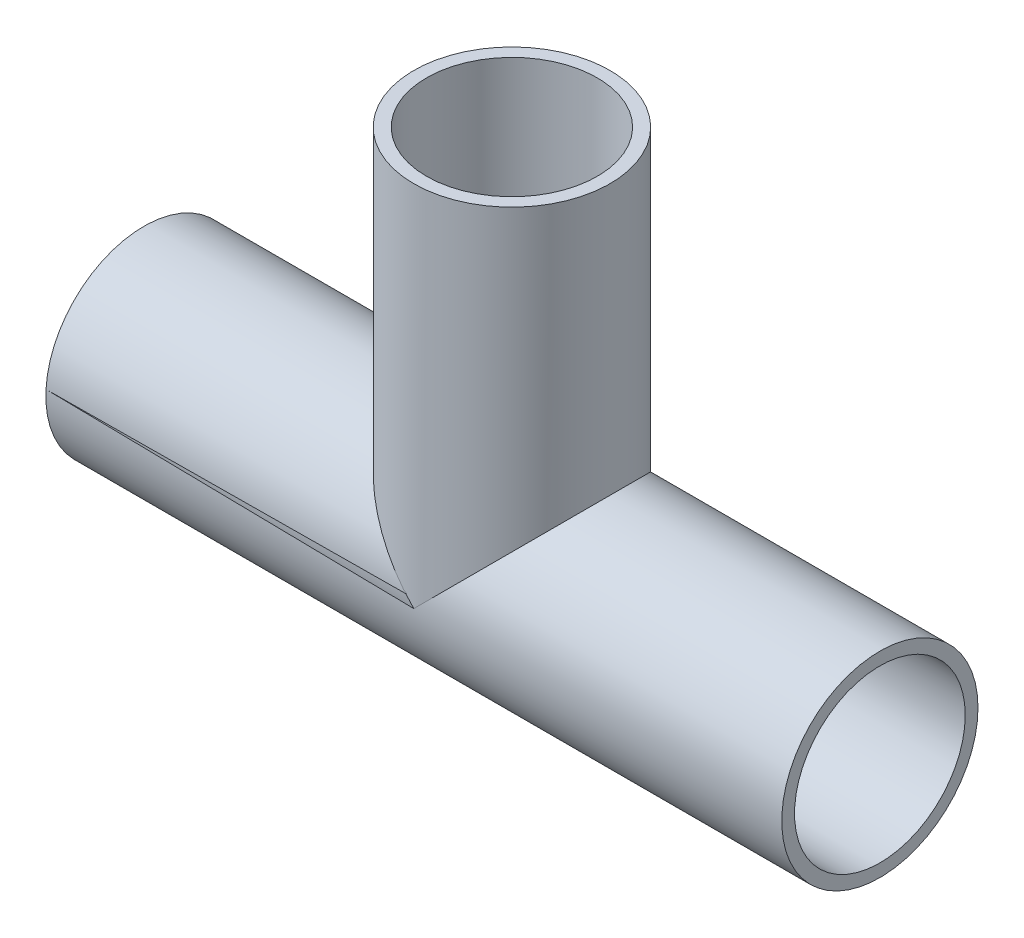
from build123d import *

# Parameters (mm, degrees)
SKETCH1_R                = 12.7
BOSS_EXTRUDE1_DEPTH      = 47.625
BOSS_EXTRUDE2_DEPTH      = 47.625
BOSS_EXTRUDE2_DEPTH_BACK = 47.625
SKETCH2_R                = 12.7
SKETCH3_R                = 11.049
CUT_EXTRUDE1_DEPTH       = 47.625
CUT_EXTRUDE2_REACH       = 109.247
SKETCH4_R                = 11.049


with BuildPart() as part:
    # Sketch1 → Boss-Extrude1 (new body)
    with BuildSketch(Plane(origin=(0, 0, 0), x_dir=(1, 0, 0), z_dir=(0, 1, 0))):
        with Locations(Location((0, 0, 0), (0, 0, 270))):
            Circle(SKETCH1_R)
    extrude(amount=BOSS_EXTRUDE1_DEPTH)

    # Sketch2 → Boss-Extrude2 (add, two sides: drawn at the far end of the back side and taken through both)
    with BuildSketch(Plane(origin=(0, 0, 0), x_dir=(0, 0, -1), z_dir=(1, 0, 0)).offset(-BOSS_EXTRUDE2_DEPTH_BACK)):
        Circle(SKETCH2_R)
    extrude(amount=BOSS_EXTRUDE2_DEPTH + BOSS_EXTRUDE2_DEPTH_BACK)

    # Sketch3 → Cut-Extrude1 (cut)
    with BuildSketch(Plane(origin=(0, 47.625, 0), x_dir=(1, 0, 0), z_dir=(0, 1, 0))):
        with Locations(Location((0, 0, 0), (0, 0, 270))):
            Circle(SKETCH3_R)
    extrude(amount=-CUT_EXTRUDE1_DEPTH, mode=Mode.SUBTRACT)

    # Sketch4 → Cut-Extrude2 (cut, up to next)
    with BuildSketch(Plane(origin=(47.625, 0, 0), x_dir=(0, 0, -1), z_dir=(1, 0, 0)), mode=Mode.PRIVATE) as cut_extrude2_sk1:
        Circle(SKETCH4_R)
    cut_extrude2_tool1 = extrude(cut_extrude2_sk1.sketch, amount=-CUT_EXTRUDE2_REACH, mode=Mode.PRIVATE) & part.part
    add(cut_extrude2_tool1.solids().sort_by_distance((47.625, 0, 0))[0], mode=Mode.SUBTRACT)


solid = part.part
